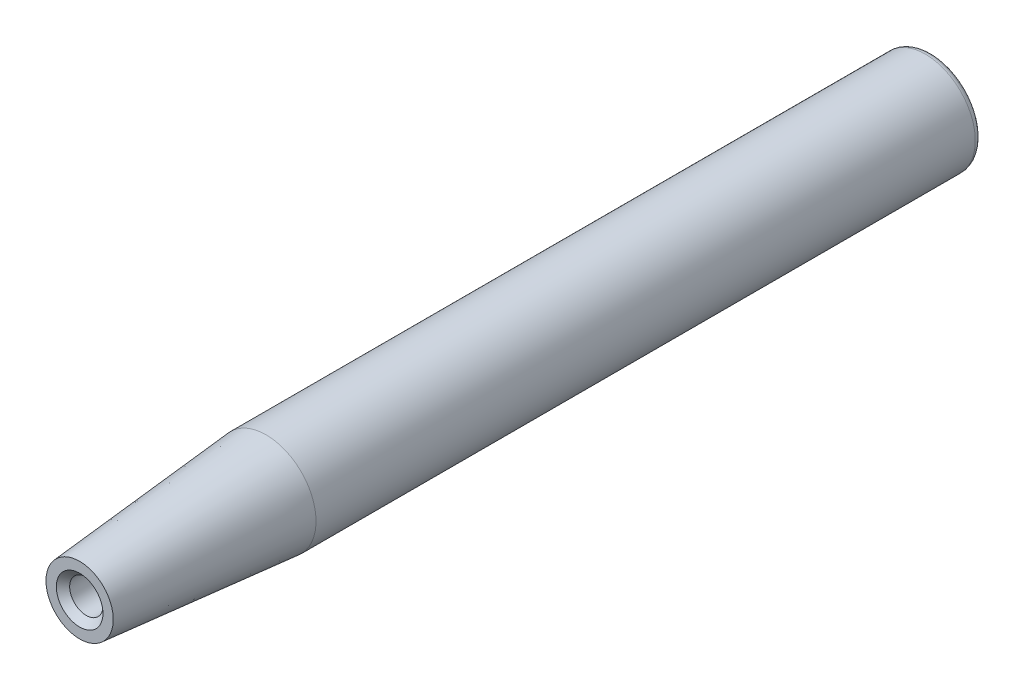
ISO-10303-21;
HEADER;
FILE_DESCRIPTION(('STEP AP214'),'2;1');
FILE_NAME('part.step','',(''),(''),'','','');
FILE_SCHEMA(('AUTOMOTIVE_DESIGN { 1 0 10303 214 1 1 1 1 }'));
ENDSEC;
DATA;
#1=APPLICATION_CONTEXT('core data for automotive mechanical design processes');
#2=APPLICATION_PROTOCOL_DEFINITION('international standard','automotive_design',2000,#1);
#3=PRODUCT_CONTEXT('',#1,'mechanical');
#4=PRODUCT('Part','Part','',(#3));
#5=PRODUCT_RELATED_PRODUCT_CATEGORY('part','',(#4));
#6=PRODUCT_DEFINITION_FORMATION('','',#4);
#7=PRODUCT_DEFINITION_CONTEXT('part definition',#1,'design');
#8=PRODUCT_DEFINITION('design','',#6,#7);
#9=PRODUCT_DEFINITION_SHAPE('','',#8);
#10=(LENGTH_UNIT() NAMED_UNIT(*) SI_UNIT(.MILLI.,.METRE.));
#11=(NAMED_UNIT(*) PLANE_ANGLE_UNIT() SI_UNIT($,.RADIAN.));
#12=(NAMED_UNIT(*) SI_UNIT($,.STERADIAN.) SOLID_ANGLE_UNIT());
#13=UNCERTAINTY_MEASURE_WITH_UNIT(LENGTH_MEASURE(1.E-05),#10,'distance_accuracy_value','');
#14=(GEOMETRIC_REPRESENTATION_CONTEXT(3) GLOBAL_UNCERTAINTY_ASSIGNED_CONTEXT((#13)) GLOBAL_UNIT_ASSIGNED_CONTEXT((#10,
#11,#12)) REPRESENTATION_CONTEXT('',''));
#15=CARTESIAN_POINT('',(0.,0.,0.));
#16=DIRECTION('',(0.,0.,1.));
#17=DIRECTION('',(1.,0.,0.));
#18=AXIS2_PLACEMENT_3D('',#15,#16,#17);
#19=CARTESIAN_POINT('',(0.,0.,-100.));
#20=DIRECTION('',(0.,0.,-1.));
#21=DIRECTION('',(-1.,0.,0.));
#22=AXIS2_PLACEMENT_3D('',#19,#20,#21);
#23=PLANE('',#22);
#24=CARTESIAN_POINT('',(0.,0.,-100.));
#25=DIRECTION('',(0.,0.,-1.));
#26=DIRECTION('',(-1.,0.,0.));
#27=AXIS2_PLACEMENT_3D('',#24,#25,#26);
#28=CIRCLE('',#27,6.5);
#29=CARTESIAN_POINT('',(-6.5,0.,-100.));
#30=VERTEX_POINT('',#29);
#31=EDGE_CURVE('E72',#30,#30,#28,.T.);
#32=ORIENTED_EDGE('',*,*,#31,.T.);
#33=EDGE_LOOP('',(#32));
#34=FACE_BOUND('',#33,.T.);
#35=ADVANCED_FACE('F45',(#34),#23,.T.);
#36=CARTESIAN_POINT('',(0.,0.,-102.874996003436));
#37=DIRECTION('',(0.,0.,-1.));
#38=DIRECTION('',(-1.,0.,0.));
#39=AXIS2_PLACEMENT_3D('',#36,#37,#38);
#40=CYLINDRICAL_SURFACE('',#39,7.5);
#41=CARTESIAN_POINT('',(0.,0.,-99.));
#42=DIRECTION('',(0.,0.,-1.));
#43=DIRECTION('',(-1.,0.,0.));
#44=AXIS2_PLACEMENT_3D('',#41,#42,#43);
#45=CIRCLE('',#44,7.5);
#46=CARTESIAN_POINT('',(-7.5,0.,-99.));
#47=VERTEX_POINT('',#46);
#48=EDGE_CURVE('E75',#47,#47,#45,.F.);
#49=ORIENTED_EDGE('',*,*,#48,.T.);
#50=EDGE_LOOP('',(#49));
#51=FACE_BOUND('',#50,.T.);
#52=CARTESIAN_POINT('',(0.,0.,0.));
#53=DIRECTION('',(0.,0.,-1.));
#54=DIRECTION('',(-1.,0.,0.));
#55=AXIS2_PLACEMENT_3D('',#52,#53,#54);
#56=CIRCLE('',#55,7.5);
#57=CARTESIAN_POINT('',(-7.49999999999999,0.,0.));
#58=VERTEX_POINT('',#57);
#59=EDGE_CURVE('E67',#58,#58,#56,.T.);
#60=ORIENTED_EDGE('',*,*,#59,.T.);
#61=EDGE_LOOP('',(#60));
#62=FACE_BOUND('',#61,.T.);
#63=ADVANCED_FACE('F88',(#51,#62),#40,.T.);
#64=CARTESIAN_POINT('',(0.,0.,0.));
#65=DIRECTION('',(0.,0.,-1.));
#66=DIRECTION('',(-1.,0.,0.));
#67=AXIS2_PLACEMENT_3D('',#64,#65,#66);
#68=CONICAL_SURFACE('',#67,7.5,0.0872664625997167);
#69=CARTESIAN_POINT('',(0.,0.,28.));
#70=DIRECTION('',(0.,0.,-1.));
#71=DIRECTION('',(-1.,0.,0.));
#72=AXIS2_PLACEMENT_3D('',#69,#70,#71);
#73=CIRCLE('',#72,5.05031742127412);
#74=CARTESIAN_POINT('',(-5.05031742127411,0.,28.));
#75=VERTEX_POINT('',#74);
#76=EDGE_CURVE('E64',#75,#75,#73,.T.);
#77=ORIENTED_EDGE('',*,*,#76,.T.);
#78=EDGE_LOOP('',(#77));
#79=FACE_BOUND('',#78,.T.);
#80=ORIENTED_EDGE('',*,*,#59,.F.);
#81=EDGE_LOOP('',(#80));
#82=FACE_BOUND('',#81,.T.);
#83=ADVANCED_FACE('F93',(#79,#82),#68,.T.);
#84=CARTESIAN_POINT('',(-5.05031742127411,0.,28.));
#85=DIRECTION('',(0.,0.,1.));
#86=DIRECTION('',(1.,0.,0.));
#87=AXIS2_PLACEMENT_3D('',#84,#85,#86);
#88=PLANE('',#87);
#89=CARTESIAN_POINT('',(0.,0.,28.));
#90=DIRECTION('',(0.,0.,1.));
#91=DIRECTION('',(1.,0.,0.));
#92=AXIS2_PLACEMENT_3D('',#89,#90,#91);
#93=CIRCLE('',#92,3.49999999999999);
#94=CARTESIAN_POINT('',(3.49999999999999,0.,28.));
#95=VERTEX_POINT('',#94);
#96=EDGE_CURVE('E11',#95,#95,#93,.F.);
#97=ORIENTED_EDGE('',*,*,#96,.T.);
#98=EDGE_LOOP('',(#97));
#99=FACE_BOUND('',#98,.T.);
#100=ORIENTED_EDGE('',*,*,#76,.F.);
#101=EDGE_LOOP('',(#100));
#102=FACE_BOUND('',#101,.T.);
#103=ADVANCED_FACE('F99',(#99,#102),#88,.T.);
#104=CARTESIAN_POINT('',(0.,0.,-99.));
#105=DIRECTION('',(0.,0.,-1.));
#106=DIRECTION('',(-1.,0.,0.));
#107=AXIS2_PLACEMENT_3D('',#104,#105,#106);
#108=TOROIDAL_SURFACE('',#107,6.5,1.);
#109=ORIENTED_EDGE('',*,*,#48,.F.);
#110=EDGE_LOOP('',(#109));
#111=FACE_BOUND('',#110,.T.);
#112=ORIENTED_EDGE('',*,*,#31,.F.);
#113=EDGE_LOOP('',(#112));
#114=FACE_BOUND('',#113,.T.);
#115=ADVANCED_FACE('F97',(#111,#114),#108,.T.);
#116=CARTESIAN_POINT('',(0.,0.,28.));
#117=DIRECTION('',(0.,0.,1.));
#118=DIRECTION('',(1.,0.,0.));
#119=AXIS2_PLACEMENT_3D('',#116,#117,#118);
#120=CYLINDRICAL_SURFACE('',#119,2.49999999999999);
#121=CARTESIAN_POINT('',(0.,0.,27.));
#122=DIRECTION('',(0.,0.,1.));
#123=DIRECTION('',(1.,0.,0.));
#124=AXIS2_PLACEMENT_3D('',#121,#122,#123);
#125=CIRCLE('',#124,2.49999999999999);
#126=CARTESIAN_POINT('',(2.49999999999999,0.,27.));
#127=VERTEX_POINT('',#126);
#128=EDGE_CURVE('E51',#127,#127,#125,.T.);
#129=ORIENTED_EDGE('',*,*,#128,.T.);
#130=EDGE_LOOP('',(#129));
#131=FACE_BOUND('',#130,.T.);
#132=CARTESIAN_POINT('',(0.,0.,11.));
#133=DIRECTION('',(0.,0.,1.));
#134=DIRECTION('',(1.,0.,0.));
#135=AXIS2_PLACEMENT_3D('',#132,#133,#134);
#136=CIRCLE('',#135,2.49999999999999);
#137=CARTESIAN_POINT('',(2.49999999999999,0.,11.));
#138=VERTEX_POINT('',#137);
#139=EDGE_CURVE('E62',#138,#138,#136,.T.);
#140=ORIENTED_EDGE('',*,*,#139,.F.);
#141=EDGE_LOOP('',(#140));
#142=FACE_BOUND('',#141,.T.);
#143=ADVANCED_FACE('F58',(#131,#142),#120,.F.);
#144=CARTESIAN_POINT('',(0.,0.,11.));
#145=DIRECTION('',(0.,0.,1.));
#146=DIRECTION('',(1.,0.,0.));
#147=AXIS2_PLACEMENT_3D('',#144,#145,#146);
#148=CONICAL_SURFACE('',#147,2.49999999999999,1.02974425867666);
#149=CARTESIAN_POINT('',(0.,0.,9.49784845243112));
#150=VERTEX_POINT('',#149);
#151=VERTEX_LOOP('',#150);
#152=FACE_BOUND('',#151,.T.);
#153=ORIENTED_EDGE('',*,*,#139,.T.);
#154=EDGE_LOOP('',(#153));
#155=FACE_BOUND('',#154,.T.);
#156=ADVANCED_FACE('F54',(#152,#155),#148,.F.);
#157=CARTESIAN_POINT('',(0.,0.,27.));
#158=DIRECTION('',(0.,0.,1.));
#159=DIRECTION('',(1.,0.,0.));
#160=AXIS2_PLACEMENT_3D('',#157,#158,#159);
#161=CONICAL_SURFACE('',#160,2.49999999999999,0.78539816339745);
#162=ORIENTED_EDGE('',*,*,#96,.F.);
#163=EDGE_LOOP('',(#162));
#164=FACE_BOUND('',#163,.T.);
#165=ORIENTED_EDGE('',*,*,#128,.F.);
#166=EDGE_LOOP('',(#165));
#167=FACE_BOUND('',#166,.T.);
#168=ADVANCED_FACE('F57',(#164,#167),#161,.F.);
#169=CLOSED_SHELL('',(#35,#63,#83,#103,#115,#143,#156,#168));
#170=MANIFOLD_SOLID_BREP('B2',#169);
#171=ADVANCED_BREP_SHAPE_REPRESENTATION('',(#18,#170),#14);
#172=SHAPE_DEFINITION_REPRESENTATION(#9,#171);
ENDSEC;
END-ISO-10303-21;
